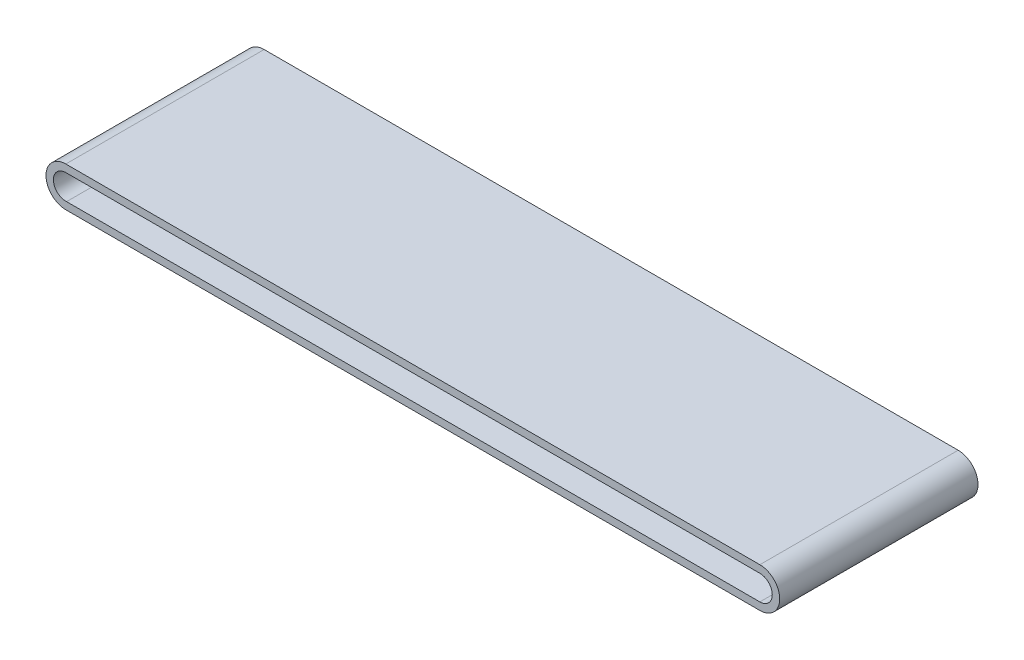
ISO-10303-21;
HEADER;
FILE_DESCRIPTION(('STEP AP214'),'2;1');
FILE_NAME('part.step','',(''),(''),'','','');
FILE_SCHEMA(('AUTOMOTIVE_DESIGN { 1 0 10303 214 1 1 1 1 }'));
ENDSEC;
DATA;
#1=APPLICATION_CONTEXT('core data for automotive mechanical design processes');
#2=APPLICATION_PROTOCOL_DEFINITION('international standard','automotive_design',2000,#1);
#3=PRODUCT_CONTEXT('',#1,'mechanical');
#4=PRODUCT('Part','Part','',(#3));
#5=PRODUCT_RELATED_PRODUCT_CATEGORY('part','',(#4));
#6=PRODUCT_DEFINITION_FORMATION('','',#4);
#7=PRODUCT_DEFINITION_CONTEXT('part definition',#1,'design');
#8=PRODUCT_DEFINITION('design','',#6,#7);
#9=PRODUCT_DEFINITION_SHAPE('','',#8);
#10=(LENGTH_UNIT() NAMED_UNIT(*) SI_UNIT(.MILLI.,.METRE.));
#11=(NAMED_UNIT(*) PLANE_ANGLE_UNIT() SI_UNIT($,.RADIAN.));
#12=(NAMED_UNIT(*) SI_UNIT($,.STERADIAN.) SOLID_ANGLE_UNIT());
#13=UNCERTAINTY_MEASURE_WITH_UNIT(LENGTH_MEASURE(1.E-05),#10,'distance_accuracy_value','');
#14=(GEOMETRIC_REPRESENTATION_CONTEXT(3) GLOBAL_UNCERTAINTY_ASSIGNED_CONTEXT((#13)) GLOBAL_UNIT_ASSIGNED_CONTEXT((#10,
#11,#12)) REPRESENTATION_CONTEXT('',''));
#15=CARTESIAN_POINT('',(0.,0.,0.));
#16=DIRECTION('',(0.,0.,1.));
#17=DIRECTION('',(1.,0.,0.));
#18=AXIS2_PLACEMENT_3D('',#15,#16,#17);
#19=CARTESIAN_POINT('',(-740.,40.,-200.));
#20=DIRECTION('',(0.,0.,1.));
#21=DIRECTION('',(1.,0.,0.));
#22=AXIS2_PLACEMENT_3D('',#19,#20,#21);
#23=PLANE('',#22);
#24=DIRECTION('',(-1.,0.,0.));
#25=VECTOR('',#24,1.);
#26=CARTESIAN_POINT('',(-740.,40.,-200.));
#27=LINE('',#26,#25);
#28=CARTESIAN_POINT('',(700.,40.,-200.));
#29=VERTEX_POINT('',#28);
#30=CARTESIAN_POINT('',(-700.,40.,-200.));
#31=VERTEX_POINT('',#30);
#32=EDGE_CURVE('E130',#29,#31,#27,.T.);
#33=ORIENTED_EDGE('',*,*,#32,.F.);
#34=CARTESIAN_POINT('',(700.,0.,-200.));
#35=DIRECTION('',(0.,0.,1.));
#36=DIRECTION('',(1.,0.,0.));
#37=AXIS2_PLACEMENT_3D('',#34,#35,#36);
#38=CIRCLE('',#37,40.);
#39=CARTESIAN_POINT('',(700.,-40.,-200.));
#40=VERTEX_POINT('',#39);
#41=EDGE_CURVE('E158',#29,#40,#38,.F.);
#42=ORIENTED_EDGE('',*,*,#41,.T.);
#43=DIRECTION('',(-1.,0.,0.));
#44=VECTOR('',#43,1.);
#45=CARTESIAN_POINT('',(-740.,-40.,-200.));
#46=LINE('',#45,#44);
#47=CARTESIAN_POINT('',(-700.,-40.,-200.));
#48=VERTEX_POINT('',#47);
#49=EDGE_CURVE('E124',#40,#48,#46,.T.);
#50=ORIENTED_EDGE('',*,*,#49,.T.);
#51=CARTESIAN_POINT('',(-700.,0.,-200.));
#52=DIRECTION('',(0.,0.,1.));
#53=DIRECTION('',(1.,0.,0.));
#54=AXIS2_PLACEMENT_3D('',#51,#52,#53);
#55=CIRCLE('',#54,40.);
#56=EDGE_CURVE('E145',#48,#31,#55,.F.);
#57=ORIENTED_EDGE('',*,*,#56,.T.);
#58=EDGE_LOOP('',(#33,#42,#50,#57));
#59=FACE_BOUND('',#58,.T.);
#60=CARTESIAN_POINT('',(700.,0.,-200.));
#61=DIRECTION('',(0.,0.,1.));
#62=DIRECTION('',(1.,0.,0.));
#63=AXIS2_PLACEMENT_3D('',#60,#61,#62);
#64=CIRCLE('',#63,25.);
#65=CARTESIAN_POINT('',(700.,25.,-200.));
#66=VERTEX_POINT('',#65);
#67=CARTESIAN_POINT('',(700.,-25.,-200.));
#68=VERTEX_POINT('',#67);
#69=EDGE_CURVE('E118',#66,#68,#64,.F.);
#70=ORIENTED_EDGE('',*,*,#69,.F.);
#71=DIRECTION('',(1.,0.,0.));
#72=VECTOR('',#71,1.);
#73=CARTESIAN_POINT('',(-700.,25.,-200.));
#74=LINE('',#73,#72);
#75=CARTESIAN_POINT('',(-698.491123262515,25.,-200.));
#76=VERTEX_POINT('',#75);
#77=EDGE_CURVE('E122',#76,#66,#74,.T.);
#78=ORIENTED_EDGE('',*,*,#77,.F.);
#79=CARTESIAN_POINT('',(-700.,0.,-200.));
#80=DIRECTION('',(0.,0.,1.));
#81=DIRECTION('',(1.,0.,0.));
#82=AXIS2_PLACEMENT_3D('',#79,#80,#81);
#83=CIRCLE('',#82,25.0454927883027);
#84=CARTESIAN_POINT('',(-698.491123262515,-25.,-200.));
#85=VERTEX_POINT('',#84);
#86=EDGE_CURVE('E62',#76,#85,#83,.T.);
#87=ORIENTED_EDGE('',*,*,#86,.T.);
#88=DIRECTION('',(1.,0.,0.));
#89=VECTOR('',#88,1.);
#90=CARTESIAN_POINT('',(-700.,-25.,-200.));
#91=LINE('',#90,#89);
#92=EDGE_CURVE('E127',#85,#68,#91,.T.);
#93=ORIENTED_EDGE('',*,*,#92,.T.);
#94=EDGE_LOOP('',(#70,#78,#87,#93));
#95=FACE_BOUND('',#94,.T.);
#96=ADVANCED_FACE('F38',(#59,#95),#23,.F.);
#97=CARTESIAN_POINT('',(-740.,40.,200.));
#98=DIRECTION('',(0.,0.,-1.));
#99=DIRECTION('',(-1.,0.,0.));
#100=AXIS2_PLACEMENT_3D('',#97,#98,#99);
#101=PLANE('',#100);
#102=DIRECTION('',(1.,0.,0.));
#103=VECTOR('',#102,1.);
#104=CARTESIAN_POINT('',(-740.,-40.,200.));
#105=LINE('',#104,#103);
#106=CARTESIAN_POINT('',(-700.,-40.,200.));
#107=VERTEX_POINT('',#106);
#108=CARTESIAN_POINT('',(700.,-40.,200.));
#109=VERTEX_POINT('',#108);
#110=EDGE_CURVE('E133',#107,#109,#105,.T.);
#111=ORIENTED_EDGE('',*,*,#110,.T.);
#112=CARTESIAN_POINT('',(700.,0.,200.));
#113=DIRECTION('',(0.,0.,-1.));
#114=DIRECTION('',(-1.,0.,0.));
#115=AXIS2_PLACEMENT_3D('',#112,#113,#114);
#116=CIRCLE('',#115,40.);
#117=CARTESIAN_POINT('',(700.,40.,200.));
#118=VERTEX_POINT('',#117);
#119=EDGE_CURVE('E156',#109,#118,#116,.F.);
#120=ORIENTED_EDGE('',*,*,#119,.T.);
#121=DIRECTION('',(1.,0.,0.));
#122=VECTOR('',#121,1.);
#123=CARTESIAN_POINT('',(-740.,40.,200.));
#124=LINE('',#123,#122);
#125=CARTESIAN_POINT('',(-700.,40.,200.));
#126=VERTEX_POINT('',#125);
#127=EDGE_CURVE('E132',#126,#118,#124,.T.);
#128=ORIENTED_EDGE('',*,*,#127,.F.);
#129=CARTESIAN_POINT('',(-700.,0.,200.));
#130=DIRECTION('',(0.,0.,-1.));
#131=DIRECTION('',(-1.,0.,0.));
#132=AXIS2_PLACEMENT_3D('',#129,#130,#131);
#133=CIRCLE('',#132,40.);
#134=EDGE_CURVE('E148',#126,#107,#133,.F.);
#135=ORIENTED_EDGE('',*,*,#134,.T.);
#136=EDGE_LOOP('',(#111,#120,#128,#135));
#137=FACE_BOUND('',#136,.T.);
#138=CARTESIAN_POINT('',(700.,0.,200.));
#139=DIRECTION('',(0.,0.,-1.));
#140=DIRECTION('',(-1.,0.,0.));
#141=AXIS2_PLACEMENT_3D('',#138,#139,#140);
#142=CIRCLE('',#141,25.);
#143=CARTESIAN_POINT('',(700.,-25.,200.));
#144=VERTEX_POINT('',#143);
#145=CARTESIAN_POINT('',(700.,25.,200.));
#146=VERTEX_POINT('',#145);
#147=EDGE_CURVE('E114',#144,#146,#142,.F.);
#148=ORIENTED_EDGE('',*,*,#147,.F.);
#149=DIRECTION('',(-1.,0.,0.));
#150=VECTOR('',#149,1.);
#151=CARTESIAN_POINT('',(-740.,-25.,200.));
#152=LINE('',#151,#150);
#153=CARTESIAN_POINT('',(-698.491123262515,-25.,200.));
#154=VERTEX_POINT('',#153);
#155=EDGE_CURVE('E47',#144,#154,#152,.T.);
#156=ORIENTED_EDGE('',*,*,#155,.T.);
#157=CARTESIAN_POINT('',(-700.,0.,200.));
#158=DIRECTION('',(0.,0.,-1.));
#159=DIRECTION('',(-1.,0.,0.));
#160=AXIS2_PLACEMENT_3D('',#157,#158,#159);
#161=CIRCLE('',#160,25.0454927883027);
#162=CARTESIAN_POINT('',(-698.491123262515,25.,200.));
#163=VERTEX_POINT('',#162);
#164=EDGE_CURVE('E162',#154,#163,#161,.T.);
#165=ORIENTED_EDGE('',*,*,#164,.T.);
#166=DIRECTION('',(-1.,0.,0.));
#167=VECTOR('',#166,1.);
#168=CARTESIAN_POINT('',(-740.,25.,200.));
#169=LINE('',#168,#167);
#170=EDGE_CURVE('E111',#146,#163,#169,.T.);
#171=ORIENTED_EDGE('',*,*,#170,.F.);
#172=EDGE_LOOP('',(#148,#156,#165,#171));
#173=FACE_BOUND('',#172,.T.);
#174=ADVANCED_FACE('F115',(#137,#173),#101,.F.);
#175=CARTESIAN_POINT('',(700.,0.,200.));
#176=DIRECTION('',(0.,0.,-1.));
#177=DIRECTION('',(-1.,0.,0.));
#178=AXIS2_PLACEMENT_3D('',#175,#176,#177);
#179=CYLINDRICAL_SURFACE('',#178,40.);
#180=DIRECTION('',(0.,0.,1.));
#181=VECTOR('',#180,1.);
#182=CARTESIAN_POINT('',(700.,40.,200.));
#183=LINE('',#182,#181);
#184=EDGE_CURVE('E150',#118,#29,#183,.F.);
#185=ORIENTED_EDGE('',*,*,#184,.F.);
#186=ORIENTED_EDGE('',*,*,#119,.F.);
#187=DIRECTION('',(0.,0.,-1.));
#188=VECTOR('',#187,1.);
#189=CARTESIAN_POINT('',(700.,-40.,0.));
#190=LINE('',#189,#188);
#191=EDGE_CURVE('E153',#40,#109,#190,.F.);
#192=ORIENTED_EDGE('',*,*,#191,.F.);
#193=ORIENTED_EDGE('',*,*,#41,.F.);
#194=EDGE_LOOP('',(#185,#186,#192,#193));
#195=FACE_BOUND('',#194,.T.);
#196=ADVANCED_FACE('F41',(#195),#179,.T.);
#197=CARTESIAN_POINT('',(-700.,0.,-200.));
#198=DIRECTION('',(0.,0.,1.));
#199=DIRECTION('',(1.,0.,0.));
#200=AXIS2_PLACEMENT_3D('',#197,#198,#199);
#201=CYLINDRICAL_SURFACE('',#200,40.);
#202=DIRECTION('',(0.,0.,-1.));
#203=VECTOR('',#202,1.);
#204=CARTESIAN_POINT('',(-700.,40.,-200.));
#205=LINE('',#204,#203);
#206=EDGE_CURVE('E136',#31,#126,#205,.F.);
#207=ORIENTED_EDGE('',*,*,#206,.F.);
#208=ORIENTED_EDGE('',*,*,#56,.F.);
#209=DIRECTION('',(0.,0.,1.));
#210=VECTOR('',#209,1.);
#211=CARTESIAN_POINT('',(-700.,-40.,0.));
#212=LINE('',#211,#210);
#213=EDGE_CURVE('E142',#107,#48,#212,.F.);
#214=ORIENTED_EDGE('',*,*,#213,.F.);
#215=ORIENTED_EDGE('',*,*,#134,.F.);
#216=EDGE_LOOP('',(#207,#208,#214,#215));
#217=FACE_BOUND('',#216,.T.);
#218=ADVANCED_FACE('F181',(#217),#201,.T.);
#219=CARTESIAN_POINT('',(0.,40.,0.));
#220=DIRECTION('',(0.,1.,0.));
#221=DIRECTION('',(0.,0.,1.));
#222=AXIS2_PLACEMENT_3D('',#219,#220,#221);
#223=PLANE('',#222);
#224=ORIENTED_EDGE('',*,*,#127,.T.);
#225=ORIENTED_EDGE('',*,*,#184,.T.);
#226=ORIENTED_EDGE('',*,*,#32,.T.);
#227=ORIENTED_EDGE('',*,*,#206,.T.);
#228=EDGE_LOOP('',(#224,#225,#226,#227));
#229=FACE_BOUND('',#228,.T.);
#230=ADVANCED_FACE('F185',(#229),#223,.T.);
#231=CARTESIAN_POINT('',(0.,-40.,0.));
#232=DIRECTION('',(0.,1.,0.));
#233=DIRECTION('',(0.,0.,1.));
#234=AXIS2_PLACEMENT_3D('',#231,#232,#233);
#235=PLANE('',#234);
#236=ORIENTED_EDGE('',*,*,#49,.F.);
#237=ORIENTED_EDGE('',*,*,#191,.T.);
#238=ORIENTED_EDGE('',*,*,#110,.F.);
#239=ORIENTED_EDGE('',*,*,#213,.T.);
#240=EDGE_LOOP('',(#236,#237,#238,#239));
#241=FACE_BOUND('',#240,.T.);
#242=ADVANCED_FACE('F191',(#241),#235,.F.);
#243=CARTESIAN_POINT('',(-700.,-25.,-200.));
#244=DIRECTION('',(0.,-1.,0.));
#245=DIRECTION('',(0.,0.,-1.));
#246=AXIS2_PLACEMENT_3D('',#243,#244,#245);
#247=PLANE('',#246);
#248=ORIENTED_EDGE('',*,*,#92,.F.);
#249=DIRECTION('',(0.,0.,-1.));
#250=VECTOR('',#249,1.);
#251=CARTESIAN_POINT('',(-698.491123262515,-25.,2168.98410623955));
#252=LINE('',#251,#250);
#253=EDGE_CURVE('E54',#85,#154,#252,.F.);
#254=ORIENTED_EDGE('',*,*,#253,.T.);
#255=ORIENTED_EDGE('',*,*,#155,.F.);
#256=DIRECTION('',(0.,0.,1.));
#257=VECTOR('',#256,1.);
#258=CARTESIAN_POINT('',(700.,-25.,-200.));
#259=LINE('',#258,#257);
#260=EDGE_CURVE('E106',#68,#144,#259,.T.);
#261=ORIENTED_EDGE('',*,*,#260,.F.);
#262=EDGE_LOOP('',(#248,#254,#255,#261));
#263=FACE_BOUND('',#262,.T.);
#264=ADVANCED_FACE('F104',(#263),#247,.F.);
#265=CARTESIAN_POINT('',(-700.,25.,-200.));
#266=DIRECTION('',(0.,-1.,0.));
#267=DIRECTION('',(1.,0.,0.));
#268=AXIS2_PLACEMENT_3D('',#265,#266,#267);
#269=PLANE('',#268);
#270=DIRECTION('',(0.,0.,-1.));
#271=VECTOR('',#270,1.);
#272=CARTESIAN_POINT('',(-698.491123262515,25.,2168.98410623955));
#273=LINE('',#272,#271);
#274=EDGE_CURVE('E11',#76,#163,#273,.F.);
#275=ORIENTED_EDGE('',*,*,#274,.F.);
#276=ORIENTED_EDGE('',*,*,#77,.T.);
#277=DIRECTION('',(0.,0.,1.));
#278=VECTOR('',#277,1.);
#279=CARTESIAN_POINT('',(700.,25.,-200.));
#280=LINE('',#279,#278);
#281=EDGE_CURVE('E121',#66,#146,#280,.T.);
#282=ORIENTED_EDGE('',*,*,#281,.T.);
#283=ORIENTED_EDGE('',*,*,#170,.T.);
#284=EDGE_LOOP('',(#275,#276,#282,#283));
#285=FACE_BOUND('',#284,.T.);
#286=ADVANCED_FACE('F161',(#285),#269,.T.);
#287=CARTESIAN_POINT('',(-700.,0.,2168.98410623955));
#288=DIRECTION('',(0.,0.,-1.));
#289=DIRECTION('',(-1.,0.,0.));
#290=AXIS2_PLACEMENT_3D('',#287,#288,#289);
#291=CYLINDRICAL_SURFACE('',#290,25.0454927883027);
#292=ORIENTED_EDGE('',*,*,#86,.F.);
#293=ORIENTED_EDGE('',*,*,#274,.T.);
#294=ORIENTED_EDGE('',*,*,#164,.F.);
#295=ORIENTED_EDGE('',*,*,#253,.F.);
#296=EDGE_LOOP('',(#292,#293,#294,#295));
#297=FACE_BOUND('',#296,.T.);
#298=ADVANCED_FACE('F165',(#297),#291,.F.);
#299=CARTESIAN_POINT('',(700.,0.,2118.98410623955));
#300=DIRECTION('',(0.,0.,-1.));
#301=DIRECTION('',(-1.,0.,0.));
#302=AXIS2_PLACEMENT_3D('',#299,#300,#301);
#303=CYLINDRICAL_SURFACE('',#302,25.);
#304=ORIENTED_EDGE('',*,*,#281,.F.);
#305=ORIENTED_EDGE('',*,*,#69,.T.);
#306=ORIENTED_EDGE('',*,*,#260,.T.);
#307=ORIENTED_EDGE('',*,*,#147,.T.);
#308=EDGE_LOOP('',(#304,#305,#306,#307));
#309=FACE_BOUND('',#308,.T.);
#310=ADVANCED_FACE('F120',(#309),#303,.F.);
#311=CLOSED_SHELL('',(#96,#174,#196,#218,#230,#242,#264,#286,#298,#310));
#312=MANIFOLD_SOLID_BREP('B2',#311);
#313=ADVANCED_BREP_SHAPE_REPRESENTATION('',(#18,#312),#14);
#314=SHAPE_DEFINITION_REPRESENTATION(#9,#313);
ENDSEC;
END-ISO-10303-21;
